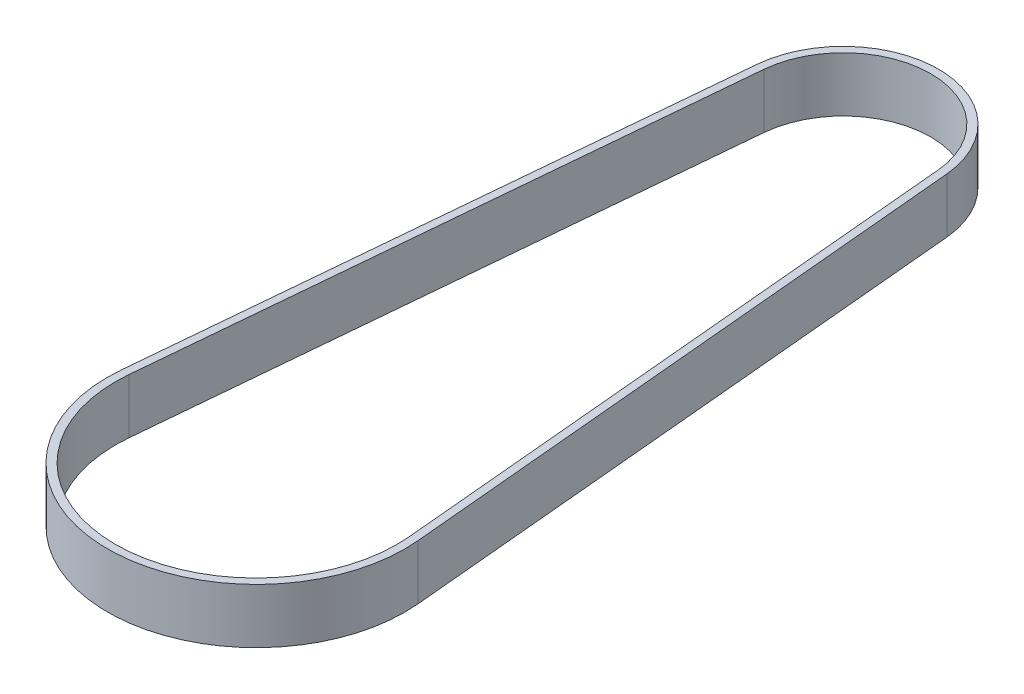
ISO-10303-21;
HEADER;
FILE_DESCRIPTION(('STEP AP214'),'2;1');
FILE_NAME('part.step','',(''),(''),'','','');
FILE_SCHEMA(('AUTOMOTIVE_DESIGN { 1 0 10303 214 1 1 1 1 }'));
ENDSEC;
DATA;
#1=APPLICATION_CONTEXT('core data for automotive mechanical design processes');
#2=APPLICATION_PROTOCOL_DEFINITION('international standard','automotive_design',2000,#1);
#3=PRODUCT_CONTEXT('',#1,'mechanical');
#4=PRODUCT('Part','Part','',(#3));
#5=PRODUCT_RELATED_PRODUCT_CATEGORY('part','',(#4));
#6=PRODUCT_DEFINITION_FORMATION('','',#4);
#7=PRODUCT_DEFINITION_CONTEXT('part definition',#1,'design');
#8=PRODUCT_DEFINITION('design','',#6,#7);
#9=PRODUCT_DEFINITION_SHAPE('','',#8);
#10=(LENGTH_UNIT() NAMED_UNIT(*) SI_UNIT(.MILLI.,.METRE.));
#11=(NAMED_UNIT(*) PLANE_ANGLE_UNIT() SI_UNIT($,.RADIAN.));
#12=(NAMED_UNIT(*) SI_UNIT($,.STERADIAN.) SOLID_ANGLE_UNIT());
#13=UNCERTAINTY_MEASURE_WITH_UNIT(LENGTH_MEASURE(1.E-05),#10,'distance_accuracy_value','');
#14=(GEOMETRIC_REPRESENTATION_CONTEXT(3) GLOBAL_UNCERTAINTY_ASSIGNED_CONTEXT((#13)) GLOBAL_UNIT_ASSIGNED_CONTEXT((#10,
#11,#12)) REPRESENTATION_CONTEXT('',''));
#15=CARTESIAN_POINT('',(0.,0.,0.));
#16=DIRECTION('',(0.,0.,1.));
#17=DIRECTION('',(1.,0.,0.));
#18=AXIS2_PLACEMENT_3D('',#15,#16,#17);
#19=CARTESIAN_POINT('',(-24.259076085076,14.,-152.215136));
#20=DIRECTION('',(0.995856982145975,0.,0.0909333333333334));
#21=DIRECTION('',(0.0909333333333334,0.,-0.995856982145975));
#22=AXIS2_PLACEMENT_3D('',#19,#20,#21);
#23=PLANE('',#22);
#24=DIRECTION('',(0.,-1.,0.));
#25=VECTOR('',#24,1.);
#26=CARTESIAN_POINT('',(-37.8425653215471,14.,-3.45546666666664));
#27=LINE('',#26,#25);
#28=CARTESIAN_POINT('',(-37.8425653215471,14.,-3.45546666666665));
#29=VERTEX_POINT('',#28);
#30=CARTESIAN_POINT('',(-37.8425653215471,0.,-3.45546666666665));
#31=VERTEX_POINT('',#30);
#32=EDGE_CURVE('E79',#29,#31,#27,.T.);
#33=ORIENTED_EDGE('',*,*,#32,.F.);
#34=DIRECTION('',(-0.0909333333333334,0.,0.995856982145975));
#35=VECTOR('',#34,1.);
#36=CARTESIAN_POINT('',(-24.2590760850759,14.,-152.215136));
#37=LINE('',#36,#35);
#38=CARTESIAN_POINT('',(-24.2590760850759,14.,-152.215136));
#39=VERTEX_POINT('',#38);
#40=EDGE_CURVE('E133',#39,#29,#37,.T.);
#41=ORIENTED_EDGE('',*,*,#40,.F.);
#42=DIRECTION('',(0.,-1.,0.));
#43=VECTOR('',#42,1.);
#44=CARTESIAN_POINT('',(-24.2590760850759,14.,-152.215136));
#45=LINE('',#44,#43);
#46=CARTESIAN_POINT('',(-24.2590760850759,0.,-152.215136));
#47=VERTEX_POINT('',#46);
#48=EDGE_CURVE('E111',#47,#39,#45,.F.);
#49=ORIENTED_EDGE('',*,*,#48,.F.);
#50=DIRECTION('',(-0.0909333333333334,0.,0.995856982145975));
#51=VECTOR('',#50,1.);
#52=CARTESIAN_POINT('',(-24.2590760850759,0.,-152.215136));
#53=LINE('',#52,#51);
#54=EDGE_CURVE('E105',#47,#31,#53,.T.);
#55=ORIENTED_EDGE('',*,*,#54,.T.);
#56=EDGE_LOOP('',(#33,#41,#49,#55));
#57=FACE_BOUND('',#56,.T.);
#58=ADVANCED_FACE('F17',(#57),#23,.F.);
#59=CARTESIAN_POINT('',(0.,14.,0.));
#60=DIRECTION('',(0.,-1.,0.));
#61=DIRECTION('',(0.,0.,-1.));
#62=AXIS2_PLACEMENT_3D('',#59,#60,#61);
#63=CYLINDRICAL_SURFACE('',#62,38.);
#64=CARTESIAN_POINT('',(0.,14.,0.));
#65=DIRECTION('',(0.,-1.,0.));
#66=DIRECTION('',(0.,0.,-1.));
#67=AXIS2_PLACEMENT_3D('',#64,#65,#66);
#68=CIRCLE('',#67,38.);
#69=CARTESIAN_POINT('',(37.8425653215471,14.,-3.45546666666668));
#70=VERTEX_POINT('',#69);
#71=EDGE_CURVE('E131',#29,#70,#68,.F.);
#72=ORIENTED_EDGE('',*,*,#71,.F.);
#73=ORIENTED_EDGE('',*,*,#32,.T.);
#74=CARTESIAN_POINT('',(0.,0.,0.));
#75=DIRECTION('',(0.,-1.,0.));
#76=DIRECTION('',(0.,0.,-1.));
#77=AXIS2_PLACEMENT_3D('',#74,#75,#76);
#78=CIRCLE('',#77,38.);
#79=CARTESIAN_POINT('',(37.8425653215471,0.,-3.45546666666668));
#80=VERTEX_POINT('',#79);
#81=EDGE_CURVE('E20',#31,#80,#78,.F.);
#82=ORIENTED_EDGE('',*,*,#81,.T.);
#83=DIRECTION('',(0.,1.,0.));
#84=VECTOR('',#83,1.);
#85=CARTESIAN_POINT('',(37.8425653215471,14.,-3.45546666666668));
#86=LINE('',#85,#84);
#87=EDGE_CURVE('E84',#80,#70,#86,.T.);
#88=ORIENTED_EDGE('',*,*,#87,.T.);
#89=EDGE_LOOP('',(#72,#73,#82,#88));
#90=FACE_BOUND('',#89,.T.);
#91=ADVANCED_FACE('F83',(#90),#63,.T.);
#92=CARTESIAN_POINT('',(37.8425653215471,14.,-3.45546666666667));
#93=DIRECTION('',(-0.995856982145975,0.,0.0909333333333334));
#94=DIRECTION('',(0.0909333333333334,0.,0.995856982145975));
#95=AXIS2_PLACEMENT_3D('',#92,#93,#94);
#96=PLANE('',#95);
#97=DIRECTION('',(0.,-1.,0.));
#98=VECTOR('',#97,1.);
#99=CARTESIAN_POINT('',(24.2590760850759,14.,-152.215136));
#100=LINE('',#99,#98);
#101=CARTESIAN_POINT('',(24.2590760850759,14.,-152.215136));
#102=VERTEX_POINT('',#101);
#103=CARTESIAN_POINT('',(24.2590760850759,0.,-152.215136));
#104=VERTEX_POINT('',#103);
#105=EDGE_CURVE('E99',#102,#104,#100,.T.);
#106=ORIENTED_EDGE('',*,*,#105,.F.);
#107=DIRECTION('',(-0.0909333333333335,0.,-0.995856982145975));
#108=VECTOR('',#107,1.);
#109=CARTESIAN_POINT('',(37.8425653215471,14.,-3.45546666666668));
#110=LINE('',#109,#108);
#111=EDGE_CURVE('E97',#70,#102,#110,.T.);
#112=ORIENTED_EDGE('',*,*,#111,.F.);
#113=ORIENTED_EDGE('',*,*,#87,.F.);
#114=DIRECTION('',(-0.0909333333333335,0.,-0.995856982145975));
#115=VECTOR('',#114,1.);
#116=CARTESIAN_POINT('',(37.8425653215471,0.,-3.45546666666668));
#117=LINE('',#116,#115);
#118=EDGE_CURVE('E89',#80,#104,#117,.T.);
#119=ORIENTED_EDGE('',*,*,#118,.T.);
#120=EDGE_LOOP('',(#106,#112,#113,#119));
#121=FACE_BOUND('',#120,.T.);
#122=ADVANCED_FACE('F94',(#121),#96,.F.);
#123=CARTESIAN_POINT('',(0.,14.,-150.));
#124=DIRECTION('',(0.,-1.,0.));
#125=DIRECTION('',(0.,0.,-1.));
#126=AXIS2_PLACEMENT_3D('',#123,#124,#125);
#127=CYLINDRICAL_SURFACE('',#126,24.36);
#128=CARTESIAN_POINT('',(0.,0.,-150.));
#129=DIRECTION('',(0.,-1.,0.));
#130=DIRECTION('',(0.,0.,-1.));
#131=AXIS2_PLACEMENT_3D('',#128,#129,#130);
#132=CIRCLE('',#131,24.36);
#133=EDGE_CURVE('E103',#104,#47,#132,.F.);
#134=ORIENTED_EDGE('',*,*,#133,.T.);
#135=ORIENTED_EDGE('',*,*,#48,.T.);
#136=CARTESIAN_POINT('',(0.,14.,-150.));
#137=DIRECTION('',(0.,-1.,0.));
#138=DIRECTION('',(0.,0.,-1.));
#139=AXIS2_PLACEMENT_3D('',#136,#137,#138);
#140=CIRCLE('',#139,24.36);
#141=EDGE_CURVE('E128',#102,#39,#140,.F.);
#142=ORIENTED_EDGE('',*,*,#141,.F.);
#143=ORIENTED_EDGE('',*,*,#105,.T.);
#144=EDGE_LOOP('',(#134,#135,#142,#143));
#145=FACE_BOUND('',#144,.T.);
#146=ADVANCED_FACE('F154',(#145),#127,.T.);
#147=CARTESIAN_POINT('',(-22.267362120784,14.,-152.033269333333));
#148=DIRECTION('',(0.995856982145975,0.,0.0909333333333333));
#149=DIRECTION('',(0.0909333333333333,0.,-0.995856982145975));
#150=AXIS2_PLACEMENT_3D('',#147,#148,#149);
#151=PLANE('',#150);
#152=DIRECTION('',(0.0909333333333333,0.,-0.995856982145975));
#153=VECTOR('',#152,1.);
#154=CARTESIAN_POINT('',(-35.8508513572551,14.,-3.27359999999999));
#155=LINE('',#154,#153);
#156=CARTESIAN_POINT('',(-35.8508513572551,14.,-3.27359999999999));
#157=VERTEX_POINT('',#156);
#158=CARTESIAN_POINT('',(-22.267362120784,14.,-152.033269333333));
#159=VERTEX_POINT('',#158);
#160=EDGE_CURVE('E124',#157,#159,#155,.T.);
#161=ORIENTED_EDGE('',*,*,#160,.F.);
#162=DIRECTION('',(0.,-1.,0.));
#163=VECTOR('',#162,1.);
#164=CARTESIAN_POINT('',(-35.8508513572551,14.,-3.27359999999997));
#165=LINE('',#164,#163);
#166=CARTESIAN_POINT('',(-35.8508513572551,0.,-3.27359999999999));
#167=VERTEX_POINT('',#166);
#168=EDGE_CURVE('E112',#157,#167,#165,.T.);
#169=ORIENTED_EDGE('',*,*,#168,.T.);
#170=DIRECTION('',(0.0909333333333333,0.,-0.995856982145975));
#171=VECTOR('',#170,1.);
#172=CARTESIAN_POINT('',(-35.8508513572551,0.,-3.27359999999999));
#173=LINE('',#172,#171);
#174=CARTESIAN_POINT('',(-22.267362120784,0.,-152.033269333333));
#175=VERTEX_POINT('',#174);
#176=EDGE_CURVE('E115',#167,#175,#173,.T.);
#177=ORIENTED_EDGE('',*,*,#176,.T.);
#178=DIRECTION('',(0.,-1.,0.));
#179=VECTOR('',#178,1.);
#180=CARTESIAN_POINT('',(-22.267362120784,14.,-152.033269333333));
#181=LINE('',#180,#179);
#182=EDGE_CURVE('E90',#175,#159,#181,.F.);
#183=ORIENTED_EDGE('',*,*,#182,.T.);
#184=EDGE_LOOP('',(#161,#169,#177,#183));
#185=FACE_BOUND('',#184,.T.);
#186=ADVANCED_FACE('F176',(#185),#151,.T.);
#187=CARTESIAN_POINT('',(0.,0.,0.));
#188=DIRECTION('',(0.,1.,0.));
#189=DIRECTION('',(0.,0.,1.));
#190=AXIS2_PLACEMENT_3D('',#187,#188,#189);
#191=PLANE('',#190);
#192=CARTESIAN_POINT('',(0.,0.,0.));
#193=DIRECTION('',(0.,-1.,0.));
#194=DIRECTION('',(0.,0.,-1.));
#195=AXIS2_PLACEMENT_3D('',#192,#193,#194);
#196=CIRCLE('',#195,36.);
#197=CARTESIAN_POINT('',(35.8508513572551,0.,-3.27359999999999));
#198=VERTEX_POINT('',#197);
#199=EDGE_CURVE('E114',#167,#198,#196,.F.);
#200=ORIENTED_EDGE('',*,*,#199,.T.);
#201=DIRECTION('',(0.0909333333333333,0.,0.995856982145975));
#202=VECTOR('',#201,1.);
#203=CARTESIAN_POINT('',(35.8508513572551,0.,-3.2736));
#204=LINE('',#203,#202);
#205=CARTESIAN_POINT('',(22.267362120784,0.,-152.033269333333));
#206=VERTEX_POINT('',#205);
#207=EDGE_CURVE('E121',#206,#198,#204,.T.);
#208=ORIENTED_EDGE('',*,*,#207,.F.);
#209=CARTESIAN_POINT('',(0.,0.,-150.));
#210=DIRECTION('',(0.,-1.,0.));
#211=DIRECTION('',(0.,0.,-1.));
#212=AXIS2_PLACEMENT_3D('',#209,#210,#211);
#213=CIRCLE('',#212,22.36);
#214=EDGE_CURVE('E122',#206,#175,#213,.F.);
#215=ORIENTED_EDGE('',*,*,#214,.T.);
#216=ORIENTED_EDGE('',*,*,#176,.F.);
#217=EDGE_LOOP('',(#200,#208,#215,#216));
#218=FACE_BOUND('',#217,.T.);
#219=ORIENTED_EDGE('',*,*,#133,.F.);
#220=ORIENTED_EDGE('',*,*,#118,.F.);
#221=ORIENTED_EDGE('',*,*,#81,.F.);
#222=ORIENTED_EDGE('',*,*,#54,.F.);
#223=EDGE_LOOP('',(#219,#220,#221,#222));
#224=FACE_BOUND('',#223,.T.);
#225=ADVANCED_FACE('F101',(#218,#224),#191,.F.);
#226=CARTESIAN_POINT('',(0.,14.,0.));
#227=DIRECTION('',(0.,-1.,0.));
#228=DIRECTION('',(0.,0.,-1.));
#229=AXIS2_PLACEMENT_3D('',#226,#227,#228);
#230=CYLINDRICAL_SURFACE('',#229,36.);
#231=ORIENTED_EDGE('',*,*,#168,.F.);
#232=CARTESIAN_POINT('',(0.,14.,0.));
#233=DIRECTION('',(0.,-1.,0.));
#234=DIRECTION('',(0.,0.,-1.));
#235=AXIS2_PLACEMENT_3D('',#232,#233,#234);
#236=CIRCLE('',#235,36.);
#237=CARTESIAN_POINT('',(35.8508513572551,14.,-3.27359999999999));
#238=VERTEX_POINT('',#237);
#239=EDGE_CURVE('E125',#238,#157,#236,.T.);
#240=ORIENTED_EDGE('',*,*,#239,.F.);
#241=DIRECTION('',(0.,1.,0.));
#242=VECTOR('',#241,1.);
#243=CARTESIAN_POINT('',(35.8508513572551,14.,-3.27359999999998));
#244=LINE('',#243,#242);
#245=EDGE_CURVE('E144',#198,#238,#244,.T.);
#246=ORIENTED_EDGE('',*,*,#245,.F.);
#247=ORIENTED_EDGE('',*,*,#199,.F.);
#248=EDGE_LOOP('',(#231,#240,#246,#247));
#249=FACE_BOUND('',#248,.T.);
#250=ADVANCED_FACE('F158',(#249),#230,.F.);
#251=CARTESIAN_POINT('',(0.,14.,0.));
#252=DIRECTION('',(0.,1.,0.));
#253=DIRECTION('',(0.,0.,1.));
#254=AXIS2_PLACEMENT_3D('',#251,#252,#253);
#255=PLANE('',#254);
#256=CARTESIAN_POINT('',(0.,14.,-150.));
#257=DIRECTION('',(0.,-1.,0.));
#258=DIRECTION('',(0.,0.,-1.));
#259=AXIS2_PLACEMENT_3D('',#256,#257,#258);
#260=CIRCLE('',#259,22.36);
#261=CARTESIAN_POINT('',(22.267362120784,14.,-152.033269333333));
#262=VERTEX_POINT('',#261);
#263=EDGE_CURVE('E35',#159,#262,#260,.T.);
#264=ORIENTED_EDGE('',*,*,#263,.T.);
#265=DIRECTION('',(0.0909333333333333,0.,0.995856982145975));
#266=VECTOR('',#265,1.);
#267=CARTESIAN_POINT('',(35.8508513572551,14.,-3.2736));
#268=LINE('',#267,#266);
#269=EDGE_CURVE('E26',#238,#262,#268,.F.);
#270=ORIENTED_EDGE('',*,*,#269,.F.);
#271=ORIENTED_EDGE('',*,*,#239,.T.);
#272=ORIENTED_EDGE('',*,*,#160,.T.);
#273=EDGE_LOOP('',(#264,#270,#271,#272));
#274=FACE_BOUND('',#273,.T.);
#275=ORIENTED_EDGE('',*,*,#111,.T.);
#276=ORIENTED_EDGE('',*,*,#141,.T.);
#277=ORIENTED_EDGE('',*,*,#40,.T.);
#278=ORIENTED_EDGE('',*,*,#71,.T.);
#279=EDGE_LOOP('',(#275,#276,#277,#278));
#280=FACE_BOUND('',#279,.T.);
#281=ADVANCED_FACE('F155',(#274,#280),#255,.T.);
#282=CARTESIAN_POINT('',(0.,14.,-150.));
#283=DIRECTION('',(0.,-1.,0.));
#284=DIRECTION('',(0.,0.,-1.));
#285=AXIS2_PLACEMENT_3D('',#282,#283,#284);
#286=CYLINDRICAL_SURFACE('',#285,22.36);
#287=ORIENTED_EDGE('',*,*,#263,.F.);
#288=ORIENTED_EDGE('',*,*,#182,.F.);
#289=ORIENTED_EDGE('',*,*,#214,.F.);
#290=DIRECTION('',(0.,1.,0.));
#291=VECTOR('',#290,1.);
#292=CARTESIAN_POINT('',(22.267362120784,14.,-152.033269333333));
#293=LINE('',#292,#291);
#294=EDGE_CURVE('E11',#262,#206,#293,.F.);
#295=ORIENTED_EDGE('',*,*,#294,.F.);
#296=EDGE_LOOP('',(#287,#288,#289,#295));
#297=FACE_BOUND('',#296,.T.);
#298=ADVANCED_FACE('F157',(#297),#286,.F.);
#299=CARTESIAN_POINT('',(35.8508513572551,14.,-3.2736));
#300=DIRECTION('',(-0.995856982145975,0.,0.0909333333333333));
#301=DIRECTION('',(0.0909333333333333,0.,0.995856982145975));
#302=AXIS2_PLACEMENT_3D('',#299,#300,#301);
#303=PLANE('',#302);
#304=ORIENTED_EDGE('',*,*,#269,.T.);
#305=ORIENTED_EDGE('',*,*,#294,.T.);
#306=ORIENTED_EDGE('',*,*,#207,.T.);
#307=ORIENTED_EDGE('',*,*,#245,.T.);
#308=EDGE_LOOP('',(#304,#305,#306,#307));
#309=FACE_BOUND('',#308,.T.);
#310=ADVANCED_FACE('F165',(#309),#303,.T.);
#311=CLOSED_SHELL('',(#58,#91,#122,#146,#186,#225,#250,#281,#298,#310));
#312=MANIFOLD_SOLID_BREP('B1',#311);
#313=ADVANCED_BREP_SHAPE_REPRESENTATION('',(#18,#312),#14);
#314=SHAPE_DEFINITION_REPRESENTATION(#9,#313);
ENDSEC;
END-ISO-10303-21;
